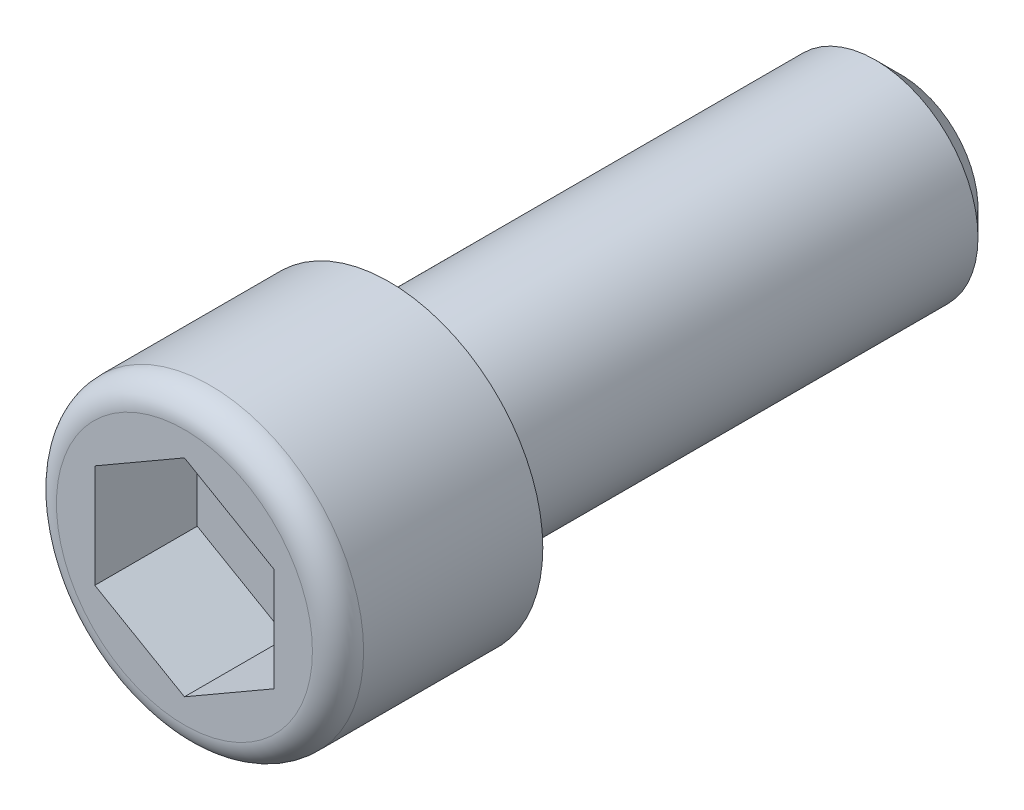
ISO-10303-21;
HEADER;
FILE_DESCRIPTION(('STEP AP214'),'2;1');
FILE_NAME('part.step','',(''),(''),'','','');
FILE_SCHEMA(('AUTOMOTIVE_DESIGN { 1 0 10303 214 1 1 1 1 }'));
ENDSEC;
DATA;
#1=APPLICATION_CONTEXT('core data for automotive mechanical design processes');
#2=APPLICATION_PROTOCOL_DEFINITION('international standard','automotive_design',2000,#1);
#3=PRODUCT_CONTEXT('',#1,'mechanical');
#4=PRODUCT('Part','Part','',(#3));
#5=PRODUCT_RELATED_PRODUCT_CATEGORY('part','',(#4));
#6=PRODUCT_DEFINITION_FORMATION('','',#4);
#7=PRODUCT_DEFINITION_CONTEXT('part definition',#1,'design');
#8=PRODUCT_DEFINITION('design','',#6,#7);
#9=PRODUCT_DEFINITION_SHAPE('','',#8);
#10=(LENGTH_UNIT() NAMED_UNIT(*) SI_UNIT(.MILLI.,.METRE.));
#11=(NAMED_UNIT(*) PLANE_ANGLE_UNIT() SI_UNIT($,.RADIAN.));
#12=(NAMED_UNIT(*) SI_UNIT($,.STERADIAN.) SOLID_ANGLE_UNIT());
#13=UNCERTAINTY_MEASURE_WITH_UNIT(LENGTH_MEASURE(1.E-05),#10,'distance_accuracy_value','');
#14=(GEOMETRIC_REPRESENTATION_CONTEXT(3) GLOBAL_UNCERTAINTY_ASSIGNED_CONTEXT((#13)) GLOBAL_UNIT_ASSIGNED_CONTEXT((#10,
#11,#12)) REPRESENTATION_CONTEXT('',''));
#15=CARTESIAN_POINT('',(0.,0.,0.));
#16=DIRECTION('',(0.,0.,1.));
#17=DIRECTION('',(1.,0.,0.));
#18=AXIS2_PLACEMENT_3D('',#15,#16,#17);
#19=CARTESIAN_POINT('',(0.,0.,-8.));
#20=DIRECTION('',(0.,0.,1.));
#21=DIRECTION('',(1.,0.,0.));
#22=AXIS2_PLACEMENT_3D('',#19,#20,#21);
#23=CYLINDRICAL_SURFACE('',#22,6.);
#24=CARTESIAN_POINT('',(0.,0.,-1.));
#25=DIRECTION('',(0.,0.,1.));
#26=DIRECTION('',(1.,0.,0.));
#27=AXIS2_PLACEMENT_3D('',#24,#25,#26);
#28=CIRCLE('',#27,6.);
#29=CARTESIAN_POINT('',(6.,0.,-1.));
#30=VERTEX_POINT('',#29);
#31=EDGE_CURVE('E11',#30,#30,#28,.F.);
#32=ORIENTED_EDGE('',*,*,#31,.T.);
#33=EDGE_LOOP('',(#32));
#34=FACE_BOUND('',#33,.T.);
#35=CARTESIAN_POINT('',(0.,0.,-8.));
#36=DIRECTION('',(0.,0.,1.));
#37=DIRECTION('',(1.,0.,0.));
#38=AXIS2_PLACEMENT_3D('',#35,#36,#37);
#39=CIRCLE('',#38,6.);
#40=CARTESIAN_POINT('',(6.,0.,-8.));
#41=VERTEX_POINT('',#40);
#42=EDGE_CURVE('E139',#41,#41,#39,.T.);
#43=ORIENTED_EDGE('',*,*,#42,.T.);
#44=EDGE_LOOP('',(#43));
#45=FACE_BOUND('',#44,.T.);
#46=ADVANCED_FACE('F37',(#34,#45),#23,.T.);
#47=CARTESIAN_POINT('',(0.,0.,-8.));
#48=DIRECTION('',(0.,0.,1.));
#49=DIRECTION('',(1.,0.,0.));
#50=AXIS2_PLACEMENT_3D('',#47,#48,#49);
#51=PLANE('',#50);
#52=CARTESIAN_POINT('',(0.,0.,-8.));
#53=DIRECTION('',(0.,0.,1.));
#54=DIRECTION('',(1.,0.,0.));
#55=AXIS2_PLACEMENT_3D('',#52,#53,#54);
#56=CIRCLE('',#55,4.);
#57=CARTESIAN_POINT('',(4.,0.,-8.));
#58=VERTEX_POINT('',#57);
#59=EDGE_CURVE('E147',#58,#58,#56,.F.);
#60=ORIENTED_EDGE('',*,*,#59,.F.);
#61=EDGE_LOOP('',(#60));
#62=FACE_BOUND('',#61,.T.);
#63=ORIENTED_EDGE('',*,*,#42,.F.);
#64=EDGE_LOOP('',(#63));
#65=FACE_BOUND('',#64,.T.);
#66=ADVANCED_FACE('F170',(#62,#65),#51,.F.);
#67=CARTESIAN_POINT('',(0.,0.,0.));
#68=DIRECTION('',(0.,0.,1.));
#69=DIRECTION('',(1.,0.,0.));
#70=AXIS2_PLACEMENT_3D('',#67,#68,#69);
#71=PLANE('',#70);
#72=CARTESIAN_POINT('',(0.,0.,0.));
#73=DIRECTION('',(0.,0.,1.));
#74=DIRECTION('',(1.,0.,0.));
#75=AXIS2_PLACEMENT_3D('',#72,#73,#74);
#76=CIRCLE('',#75,5.);
#77=CARTESIAN_POINT('',(5.,0.,0.));
#78=VERTEX_POINT('',#77);
#79=EDGE_CURVE('E45',#78,#78,#76,.T.);
#80=ORIENTED_EDGE('',*,*,#79,.T.);
#81=EDGE_LOOP('',(#80));
#82=FACE_BOUND('',#81,.T.);
#83=DIRECTION('',(0.,-1.,0.));
#84=VECTOR('',#83,1.);
#85=CARTESIAN_POINT('',(-3.5,2.02072594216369,0.));
#86=LINE('',#85,#84);
#87=CARTESIAN_POINT('',(-3.5,2.02072594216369,0.));
#88=VERTEX_POINT('',#87);
#89=CARTESIAN_POINT('',(-3.5,-2.02072594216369,0.));
#90=VERTEX_POINT('',#89);
#91=EDGE_CURVE('E52',#88,#90,#86,.T.);
#92=ORIENTED_EDGE('',*,*,#91,.F.);
#93=DIRECTION('',(-0.866025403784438,-0.5,0.));
#94=VECTOR('',#93,1.);
#95=CARTESIAN_POINT('',(0.,4.04145188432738,0.));
#96=LINE('',#95,#94);
#97=CARTESIAN_POINT('',(0.,4.04145188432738,0.));
#98=VERTEX_POINT('',#97);
#99=EDGE_CURVE('E135',#98,#88,#96,.T.);
#100=ORIENTED_EDGE('',*,*,#99,.F.);
#101=DIRECTION('',(-0.866025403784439,0.5,0.));
#102=VECTOR('',#101,1.);
#103=CARTESIAN_POINT('',(3.5,2.02072594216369,0.));
#104=LINE('',#103,#102);
#105=CARTESIAN_POINT('',(3.5,2.02072594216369,0.));
#106=VERTEX_POINT('',#105);
#107=EDGE_CURVE('E133',#106,#98,#104,.T.);
#108=ORIENTED_EDGE('',*,*,#107,.F.);
#109=DIRECTION('',(0.,1.,0.));
#110=VECTOR('',#109,1.);
#111=CARTESIAN_POINT('',(3.5,-2.02072594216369,0.));
#112=LINE('',#111,#110);
#113=CARTESIAN_POINT('',(3.5,-2.02072594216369,0.));
#114=VERTEX_POINT('',#113);
#115=EDGE_CURVE('E100',#114,#106,#112,.T.);
#116=ORIENTED_EDGE('',*,*,#115,.F.);
#117=DIRECTION('',(0.866025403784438,0.5,0.));
#118=VECTOR('',#117,1.);
#119=CARTESIAN_POINT('',(0.,-4.04145188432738,0.));
#120=LINE('',#119,#118);
#121=CARTESIAN_POINT('',(0.,-4.04145188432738,0.));
#122=VERTEX_POINT('',#121);
#123=EDGE_CURVE('E129',#122,#114,#120,.T.);
#124=ORIENTED_EDGE('',*,*,#123,.F.);
#125=DIRECTION('',(0.866025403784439,-0.5,0.));
#126=VECTOR('',#125,1.);
#127=CARTESIAN_POINT('',(-3.5,-2.02072594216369,0.));
#128=LINE('',#127,#126);
#129=EDGE_CURVE('E126',#90,#122,#128,.T.);
#130=ORIENTED_EDGE('',*,*,#129,.F.);
#131=EDGE_LOOP('',(#92,#100,#108,#116,#124,#130));
#132=FACE_BOUND('',#131,.T.);
#133=ADVANCED_FACE('F158',(#82,#132),#71,.T.);
#134=CARTESIAN_POINT('',(0.,0.,-28.));
#135=DIRECTION('',(0.,0.,1.));
#136=DIRECTION('',(1.,0.,0.));
#137=AXIS2_PLACEMENT_3D('',#134,#135,#136);
#138=CYLINDRICAL_SURFACE('',#137,4.);
#139=CARTESIAN_POINT('',(0.,0.,-27.));
#140=DIRECTION('',(0.,0.,-1.));
#141=DIRECTION('',(-1.,0.,0.));
#142=AXIS2_PLACEMENT_3D('',#139,#140,#141);
#143=CIRCLE('',#142,4.);
#144=CARTESIAN_POINT('',(-4.,0.,-27.));
#145=VERTEX_POINT('',#144);
#146=EDGE_CURVE('E153',#145,#145,#143,.F.);
#147=ORIENTED_EDGE('',*,*,#146,.T.);
#148=EDGE_LOOP('',(#147));
#149=FACE_BOUND('',#148,.T.);
#150=ORIENTED_EDGE('',*,*,#59,.T.);
#151=EDGE_LOOP('',(#150));
#152=FACE_BOUND('',#151,.T.);
#153=ADVANCED_FACE('F191',(#149,#152),#138,.T.);
#154=CARTESIAN_POINT('',(0.,0.,-28.));
#155=DIRECTION('',(0.,0.,-1.));
#156=DIRECTION('',(-1.,0.,0.));
#157=AXIS2_PLACEMENT_3D('',#154,#155,#156);
#158=PLANE('',#157);
#159=CARTESIAN_POINT('',(0.,0.,-28.));
#160=DIRECTION('',(0.,0.,-1.));
#161=DIRECTION('',(-1.,0.,0.));
#162=AXIS2_PLACEMENT_3D('',#159,#160,#161);
#163=CIRCLE('',#162,3.);
#164=CARTESIAN_POINT('',(-3.,0.,-28.));
#165=VERTEX_POINT('',#164);
#166=EDGE_CURVE('E150',#165,#165,#163,.T.);
#167=ORIENTED_EDGE('',*,*,#166,.T.);
#168=EDGE_LOOP('',(#167));
#169=FACE_BOUND('',#168,.T.);
#170=ADVANCED_FACE('F183',(#169),#158,.T.);
#171=CARTESIAN_POINT('',(0.,0.,-28.));
#172=DIRECTION('',(0.,0.,1.));
#173=DIRECTION('',(1.,0.,0.));
#174=AXIS2_PLACEMENT_3D('',#171,#172,#173);
#175=CONICAL_SURFACE('',#174,3.,0.785398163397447);
#176=ORIENTED_EDGE('',*,*,#146,.F.);
#177=EDGE_LOOP('',(#176));
#178=FACE_BOUND('',#177,.T.);
#179=ORIENTED_EDGE('',*,*,#166,.F.);
#180=EDGE_LOOP('',(#179));
#181=FACE_BOUND('',#180,.T.);
#182=ADVANCED_FACE('F180',(#178,#181),#175,.T.);
#183=CARTESIAN_POINT('',(-3.5,2.02072594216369,-4.));
#184=DIRECTION('',(-1.,0.,0.));
#185=DIRECTION('',(0.,-1.,0.));
#186=AXIS2_PLACEMENT_3D('',#183,#184,#185);
#187=PLANE('',#186);
#188=ORIENTED_EDGE('',*,*,#91,.T.);
#189=DIRECTION('',(0.,0.,1.));
#190=VECTOR('',#189,1.);
#191=CARTESIAN_POINT('',(-3.5,-2.02072594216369,-4.));
#192=LINE('',#191,#190);
#193=CARTESIAN_POINT('',(-3.5,-2.02072594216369,-4.));
#194=VERTEX_POINT('',#193);
#195=EDGE_CURVE('E82',#194,#90,#192,.T.);
#196=ORIENTED_EDGE('',*,*,#195,.F.);
#197=DIRECTION('',(0.,-1.,0.));
#198=VECTOR('',#197,1.);
#199=CARTESIAN_POINT('',(-3.5,2.02072594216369,-4.));
#200=LINE('',#199,#198);
#201=CARTESIAN_POINT('',(-3.5,2.02072594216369,-4.));
#202=VERTEX_POINT('',#201);
#203=EDGE_CURVE('E137',#202,#194,#200,.T.);
#204=ORIENTED_EDGE('',*,*,#203,.F.);
#205=DIRECTION('',(0.,0.,1.));
#206=VECTOR('',#205,1.);
#207=CARTESIAN_POINT('',(-3.5,2.02072594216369,-4.));
#208=LINE('',#207,#206);
#209=EDGE_CURVE('E60',#202,#88,#208,.T.);
#210=ORIENTED_EDGE('',*,*,#209,.T.);
#211=EDGE_LOOP('',(#188,#196,#204,#210));
#212=FACE_BOUND('',#211,.T.);
#213=ADVANCED_FACE('F182',(#212),#187,.F.);
#214=CARTESIAN_POINT('',(0.,4.04145188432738,-4.));
#215=DIRECTION('',(-0.5,0.866025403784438,0.));
#216=DIRECTION('',(-0.866025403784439,-0.5,0.));
#217=AXIS2_PLACEMENT_3D('',#214,#215,#216);
#218=PLANE('',#217);
#219=ORIENTED_EDGE('',*,*,#99,.T.);
#220=ORIENTED_EDGE('',*,*,#209,.F.);
#221=DIRECTION('',(-0.866025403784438,-0.5,0.));
#222=VECTOR('',#221,1.);
#223=CARTESIAN_POINT('',(0.,4.04145188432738,-4.));
#224=LINE('',#223,#222);
#225=CARTESIAN_POINT('',(0.,4.04145188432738,-4.));
#226=VERTEX_POINT('',#225);
#227=EDGE_CURVE('E112',#226,#202,#224,.T.);
#228=ORIENTED_EDGE('',*,*,#227,.F.);
#229=DIRECTION('',(0.,0.,1.));
#230=VECTOR('',#229,1.);
#231=CARTESIAN_POINT('',(0.,4.04145188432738,-4.));
#232=LINE('',#231,#230);
#233=EDGE_CURVE('E104',#226,#98,#232,.T.);
#234=ORIENTED_EDGE('',*,*,#233,.T.);
#235=EDGE_LOOP('',(#219,#220,#228,#234));
#236=FACE_BOUND('',#235,.T.);
#237=ADVANCED_FACE('F189',(#236),#218,.F.);
#238=CARTESIAN_POINT('',(3.5,2.02072594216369,-4.));
#239=DIRECTION('',(0.5,0.866025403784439,0.));
#240=DIRECTION('',(-0.866025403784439,0.5,0.));
#241=AXIS2_PLACEMENT_3D('',#238,#239,#240);
#242=PLANE('',#241);
#243=ORIENTED_EDGE('',*,*,#107,.T.);
#244=ORIENTED_EDGE('',*,*,#233,.F.);
#245=DIRECTION('',(-0.866025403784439,0.5,0.));
#246=VECTOR('',#245,1.);
#247=CARTESIAN_POINT('',(3.5,2.02072594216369,-4.));
#248=LINE('',#247,#246);
#249=CARTESIAN_POINT('',(3.5,2.02072594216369,-4.));
#250=VERTEX_POINT('',#249);
#251=EDGE_CURVE('E108',#250,#226,#248,.T.);
#252=ORIENTED_EDGE('',*,*,#251,.F.);
#253=DIRECTION('',(0.,0.,1.));
#254=VECTOR('',#253,1.);
#255=CARTESIAN_POINT('',(3.5,2.02072594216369,-4.));
#256=LINE('',#255,#254);
#257=EDGE_CURVE('E93',#250,#106,#256,.T.);
#258=ORIENTED_EDGE('',*,*,#257,.T.);
#259=EDGE_LOOP('',(#243,#244,#252,#258));
#260=FACE_BOUND('',#259,.T.);
#261=ADVANCED_FACE('F109',(#260),#242,.F.);
#262=CARTESIAN_POINT('',(3.5,-2.02072594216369,-4.));
#263=DIRECTION('',(1.,0.,0.));
#264=DIRECTION('',(0.,0.,-1.));
#265=AXIS2_PLACEMENT_3D('',#262,#263,#264);
#266=PLANE('',#265);
#267=ORIENTED_EDGE('',*,*,#115,.T.);
#268=ORIENTED_EDGE('',*,*,#257,.F.);
#269=DIRECTION('',(0.,1.,0.));
#270=VECTOR('',#269,1.);
#271=CARTESIAN_POINT('',(3.5,-2.02072594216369,-4.));
#272=LINE('',#271,#270);
#273=CARTESIAN_POINT('',(3.5,-2.02072594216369,-4.));
#274=VERTEX_POINT('',#273);
#275=EDGE_CURVE('E97',#274,#250,#272,.T.);
#276=ORIENTED_EDGE('',*,*,#275,.F.);
#277=DIRECTION('',(0.,0.,1.));
#278=VECTOR('',#277,1.);
#279=CARTESIAN_POINT('',(3.5,-2.02072594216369,-4.));
#280=LINE('',#279,#278);
#281=EDGE_CURVE('E105',#274,#114,#280,.T.);
#282=ORIENTED_EDGE('',*,*,#281,.T.);
#283=EDGE_LOOP('',(#267,#268,#276,#282));
#284=FACE_BOUND('',#283,.T.);
#285=ADVANCED_FACE('F95',(#284),#266,.F.);
#286=CARTESIAN_POINT('',(0.,-4.04145188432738,-4.));
#287=DIRECTION('',(0.5,-0.866025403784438,0.));
#288=DIRECTION('',(0.866025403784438,0.5,0.));
#289=AXIS2_PLACEMENT_3D('',#286,#287,#288);
#290=PLANE('',#289);
#291=ORIENTED_EDGE('',*,*,#123,.T.);
#292=ORIENTED_EDGE('',*,*,#281,.F.);
#293=DIRECTION('',(0.866025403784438,0.5,0.));
#294=VECTOR('',#293,1.);
#295=CARTESIAN_POINT('',(0.,-4.04145188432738,-4.));
#296=LINE('',#295,#294);
#297=CARTESIAN_POINT('',(0.,-4.04145188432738,-4.));
#298=VERTEX_POINT('',#297);
#299=EDGE_CURVE('E118',#298,#274,#296,.T.);
#300=ORIENTED_EDGE('',*,*,#299,.F.);
#301=DIRECTION('',(0.,0.,1.));
#302=VECTOR('',#301,1.);
#303=CARTESIAN_POINT('',(0.,-4.04145188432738,-4.));
#304=LINE('',#303,#302);
#305=EDGE_CURVE('E142',#298,#122,#304,.T.);
#306=ORIENTED_EDGE('',*,*,#305,.T.);
#307=EDGE_LOOP('',(#291,#292,#300,#306));
#308=FACE_BOUND('',#307,.T.);
#309=ADVANCED_FACE('F210',(#308),#290,.F.);
#310=CARTESIAN_POINT('',(-3.5,-2.02072594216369,-4.));
#311=DIRECTION('',(-0.5,-0.866025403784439,0.));
#312=DIRECTION('',(0.866025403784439,-0.5,0.));
#313=AXIS2_PLACEMENT_3D('',#310,#311,#312);
#314=PLANE('',#313);
#315=ORIENTED_EDGE('',*,*,#129,.T.);
#316=ORIENTED_EDGE('',*,*,#305,.F.);
#317=DIRECTION('',(0.866025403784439,-0.5,0.));
#318=VECTOR('',#317,1.);
#319=CARTESIAN_POINT('',(-3.5,-2.02072594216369,-4.));
#320=LINE('',#319,#318);
#321=EDGE_CURVE('E120',#194,#298,#320,.T.);
#322=ORIENTED_EDGE('',*,*,#321,.F.);
#323=ORIENTED_EDGE('',*,*,#195,.T.);
#324=EDGE_LOOP('',(#315,#316,#322,#323));
#325=FACE_BOUND('',#324,.T.);
#326=ADVANCED_FACE('F166',(#325),#314,.F.);
#327=CARTESIAN_POINT('',(-3.5,6.06217782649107,-4.));
#328=DIRECTION('',(0.,0.,-1.));
#329=DIRECTION('',(-1.,0.,0.));
#330=AXIS2_PLACEMENT_3D('',#327,#328,#329);
#331=PLANE('',#330);
#332=ORIENTED_EDGE('',*,*,#203,.T.);
#333=ORIENTED_EDGE('',*,*,#321,.T.);
#334=ORIENTED_EDGE('',*,*,#299,.T.);
#335=ORIENTED_EDGE('',*,*,#275,.T.);
#336=ORIENTED_EDGE('',*,*,#251,.T.);
#337=ORIENTED_EDGE('',*,*,#227,.T.);
#338=EDGE_LOOP('',(#332,#333,#334,#335,#336,#337));
#339=FACE_BOUND('',#338,.T.);
#340=ADVANCED_FACE('F115',(#339),#331,.F.);
#341=CARTESIAN_POINT('',(0.,0.,-1.));
#342=DIRECTION('',(0.,0.,1.));
#343=DIRECTION('',(1.,0.,0.));
#344=AXIS2_PLACEMENT_3D('',#341,#342,#343);
#345=TOROIDAL_SURFACE('',#344,5.,1.);
#346=ORIENTED_EDGE('',*,*,#31,.F.);
#347=EDGE_LOOP('',(#346));
#348=FACE_BOUND('',#347,.T.);
#349=ORIENTED_EDGE('',*,*,#79,.F.);
#350=EDGE_LOOP('',(#349));
#351=FACE_BOUND('',#350,.T.);
#352=ADVANCED_FACE('F39',(#348,#351),#345,.T.);
#353=CLOSED_SHELL('',(#46,#66,#133,#153,#170,#182,#213,#237,#261,#285,#309,#326,#340,#352));
#354=MANIFOLD_SOLID_BREP('B2',#353);
#355=ADVANCED_BREP_SHAPE_REPRESENTATION('',(#18,#354),#14);
#356=SHAPE_DEFINITION_REPRESENTATION(#9,#355);
ENDSEC;
END-ISO-10303-21;
